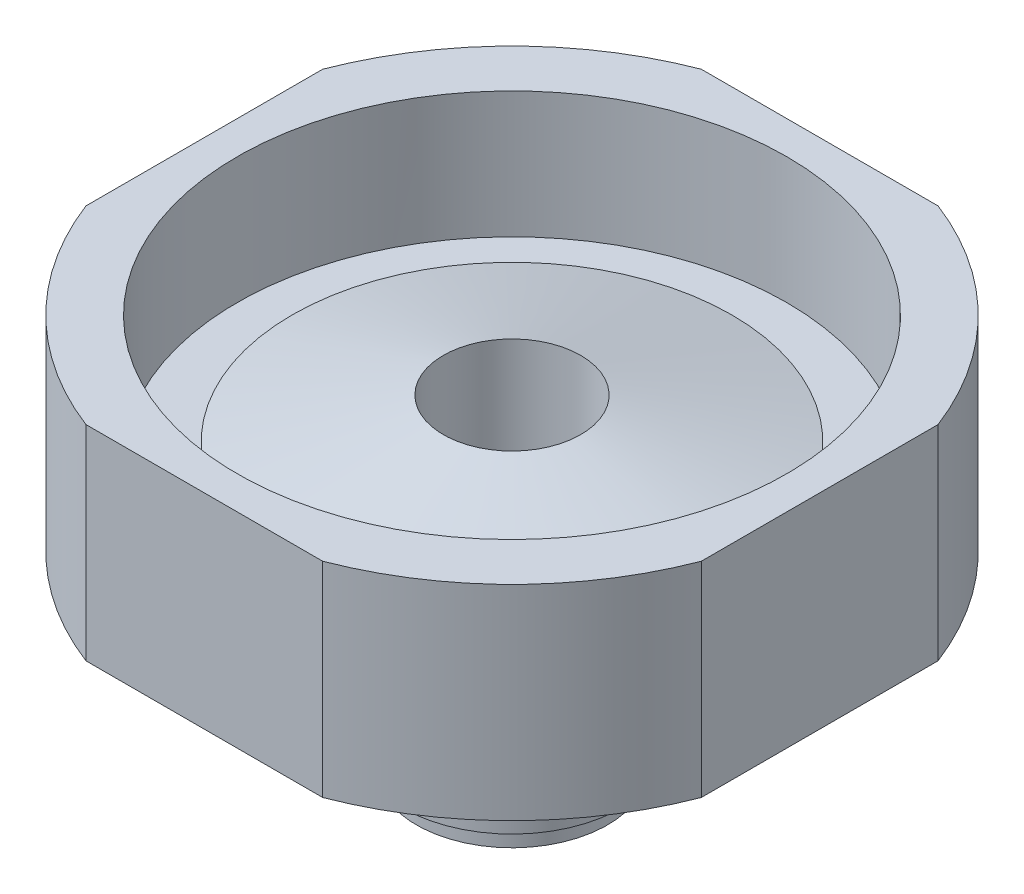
from build123d import *

# Parameters (mm, degrees)
SKETCH5_R          = 15.875
SKETCH5_R_2        = 12.7
CUT_EXTRUDE3_DEPTH = 7.3025
CUT_EXTRUDE4_DEPTH = 36.259264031


with BuildPart() as part:
    # Sketch1 → Revolve1 (revolve)
    with BuildSketch(Plane.XY, mode=Mode.PRIVATE) as revolve1_sk:
        Polygon((6.35, -2.299663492), (6.35, -11.951663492), (5.5245, -11.951663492), (5.5245, -13.221663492), (5.08, -13.221663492), (3.96875, -10.046663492), (3.96875, -1.089835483), (3.96875, 5.532284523), (15.875, 2.342014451), (15.875, 5.532284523), (15.875, 9.525), (19.05, 9.525), (19.05, 0), (19.05, -2.299663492), align=None)
    revolve(revolve1_sk.sketch.rotate(Axis((0, 0, 0), (0, 1, 0)), 90), axis=Axis((0, 0, 0), (0, 1, 0)))

    # Sketch5 → Cut-Extrude3 (cut)
    with BuildSketch(Plane(origin=(0, 9.525, 0), x_dir=(1, 0, 0), z_dir=(0, 1, 0))):
        with Locations(Location((0, 0, 0), (0, 0, 90))):
            Circle(SKETCH5_R)
        with Locations(Location((0, 0, 0), (0, 0, 270))):
            Circle(SKETCH5_R_2, mode=Mode.SUBTRACT)
    extrude(amount=-CUT_EXTRUDE3_DEPTH, mode=Mode.SUBTRACT)

    # Sketch6 → Cut-Extrude4 (cut, through all)
    with BuildSketch(Plane(origin=(0, 9.525, 0), x_dir=(1, 0, 0), z_dir=(0, 1, 0))):
        Polygon((17.78, 0), (17.78, 8.20829421), (21.914509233, 8.20829421), (21.914509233, -6.839159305), (17.78, -6.839159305), align=None)
        Polygon((-21.914509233, 8.20829421), (-17.78, 8.20829421), (-17.78, 0), (-17.78, -6.839159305), (-21.914509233, -6.839159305), align=None)
        Polygon((0, 17.78), (10.513771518, 17.78), (10.513771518, 20.769170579), (-9.16228482, 20.769170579), (-9.16228482, 17.78), align=None)
        Polygon((-9.16228482, -17.78), (0, -17.78), (10.513771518, -17.78), (10.513771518, -20.769170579), (-9.16228482, -20.769170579), align=None)
    extrude(amount=-CUT_EXTRUDE4_DEPTH, mode=Mode.SUBTRACT)


solid = part.part
